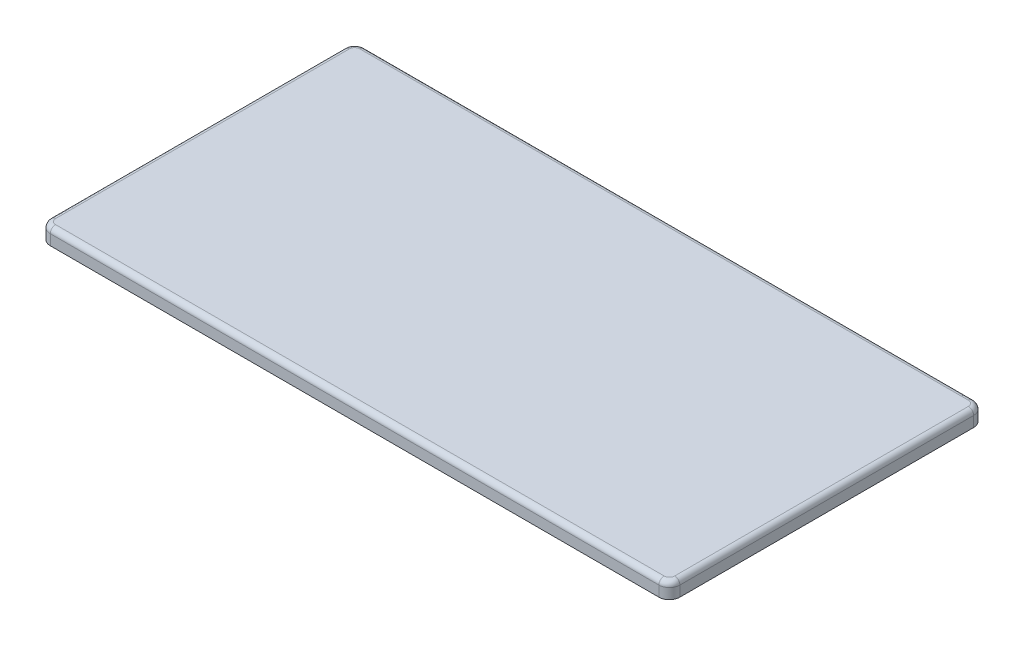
from build123d import *

# Parameters (mm, degrees)
EXTRUDE_1_DEPTH           = 1.5
FILLET_1_R                = 1
CUT_EXTRUDE_2_DEPTH       = 1
SKETCH_4_W                = 4.9
SKETCH_4_H                = 3.2
EXTRUDE_4_DEPTH           = 8
EXTRUDE_4_DRAFT           = 0.6
EXTRUDE_4_PROFILE_2_DEPTH = 8
EXTRUDE_4_PROFILE_2_DRAFT = 0.6
EXTRUDE_4_PROFILE_3_DEPTH = 8
EXTRUDE_4_PROFILE_3_DRAFT = 0.6
EXTRUDE_4_PROFILE_4_DEPTH = 8
EXTRUDE_4_PROFILE_4_DRAFT = 0.6
EXTRUDE_4_PROFILE_5_DEPTH = 8
EXTRUDE_4_PROFILE_5_DRAFT = 0.6
EXTRUDE_4_PROFILE_6_DEPTH = 8
EXTRUDE_4_PROFILE_6_DRAFT = 0.6
EXTRUDE_4_PROFILE_7_DEPTH = 8
EXTRUDE_4_PROFILE_7_DRAFT = 0.6
EXTRUDE_4_PROFILE_8_DEPTH = 8
EXTRUDE_4_PROFILE_8_DRAFT = 0.6
FILLET_2_R                = 0.8


with BuildPart() as part:
    # Sketch 1 → Extrude 1 (new, symmetric)
    with BuildSketch(Plane(origin=(0, 0, 0), x_dir=(0, 0, -1), z_dir=(0, 1, 0))):
        with BuildLine():
            Line((-28, 60), (28, 60))
            ThreePointArc((28, 60), (29.414213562, 59.414213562), (30, 58))
            Line((30, 58), (30, -58))
            ThreePointArc((30, -58), (29.414213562, -59.414213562), (28, -60))
            Line((28, -60), (-28, -60))
            ThreePointArc((-28, -60), (-29.414213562, -59.414213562), (-30, -58))
            Line((-30, -58), (-30, 58))
            ThreePointArc((-30, 58), (-29.414213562, 59.414213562), (-28, 60))
        make_face()
    extrude(amount=EXTRUDE_1_DEPTH, both=True)

    # Fillet 1
    fillet_1_edges = [part.edges().sort_by_distance(p)[0] for p in [
        (-59.414213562, 1.5, 29.414213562),
        (0, 1.5, 30),
        (59.414213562, 1.5, 29.414213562),
        (60, 1.5, 0),
        (59.414213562, 1.5, -29.414213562),
        (0, 1.5, -30),
        (-59.414213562, 1.5, -29.414213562),
        (-60, 1.5, 0),
    ]]
    fillet(fillet_1_edges, radius=FILLET_1_R)

    # Sketch 2 → Cut-Extrude 2 (cut)
    with BuildSketch(Plane.XZ.offset(1.5)):
        with BuildLine():
            Line((-58, 28.2), (58, 28.2))
            ThreePointArc((58, 28.2), (58.141421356, 28.141421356), (58.2, 28))
            Line((58.2, 28), (58.2, -28))
            ThreePointArc((58.2, -28), (58.141421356, -28.141421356), (58, -28.2))
            Line((58, -28.2), (-58, -28.2))
            ThreePointArc((-58, -28.2), (-58.141421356, -28.141421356), (-58.2, -28))
            Line((-58.2, -28), (-58.2, 28))
            ThreePointArc((-58.2, 28), (-58.141421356, 28.141421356), (-58, 28.2))
        make_face()
    extrude(amount=-CUT_EXTRUDE_2_DEPTH, mode=Mode.SUBTRACT)


with BuildPart() as extrude_4_tool:
    # Sketch 4 → Extrude 4 (with draft: the straight prism first)
    with BuildSketch(Plane.XZ.offset(0.5)):
        with Locations((-45, 15.85)):
            Rectangle(SKETCH_4_W, SKETCH_4_H)
    extrude(amount=EXTRUDE_4_DEPTH)
    # Extrude 4: the draft: its side faces are tilted about the plane it starts from
    extrude_4_sides = [extrude_4_tool.faces().sort_by_distance(p)[0] for p in [
        (-47.45, -4.5, 15.85),
        (-45, -4.5, 14.25),
        (-42.55, -4.5, 15.85),
        (-45, -4.5, 17.45),
    ]]
    draft(extrude_4_sides, Plane.XZ.offset(0.5), EXTRUDE_4_DRAFT)


with BuildPart() as part_1:
    add(part.part)

    # Extrude 4: add extrude_4_tool
    add(extrude_4_tool.part)


with BuildPart() as extrude_4_profile_2_tool:
    # Sketch 4 → Extrude 4 profile 2 (with draft: the straight prism first)
    with BuildSketch(Plane.XZ.offset(0.5)):
        with Locations((45, 15.85)):
            Rectangle(SKETCH_4_W, SKETCH_4_H)
    extrude(amount=EXTRUDE_4_PROFILE_2_DEPTH)
    # Extrude 4 profile 2: the draft: its side faces are tilted about the plane it starts from
    extrude_4_profile_2_sides = [extrude_4_profile_2_tool.faces().sort_by_distance(p)[0] for p in [
        (45, -4.5, 14.25),
        (47.45, -4.5, 15.85),
        (45, -4.5, 17.45),
        (42.55, -4.5, 15.85),
    ]]
    draft(extrude_4_profile_2_sides, Plane.XZ.offset(0.5), EXTRUDE_4_PROFILE_2_DRAFT)


with BuildPart() as part_2:
    add(part_1.part)

    # Extrude 4 profile 2: add extrude_4_profile_2_tool
    add(extrude_4_profile_2_tool.part)


with BuildPart() as extrude_4_profile_3_tool:
    # Sketch 4 → Extrude 4 profile 3 (with draft: the straight prism first)
    with BuildSketch(Plane.XZ.offset(0.5)):
        with Locations((-45, -15.85)):
            Rectangle(SKETCH_4_W, SKETCH_4_H)
    extrude(amount=EXTRUDE_4_PROFILE_3_DEPTH)
    # Extrude 4 profile 3: the draft: its side faces are tilted about the plane it starts from
    extrude_4_profile_3_sides = [extrude_4_profile_3_tool.faces().sort_by_distance(p)[0] for p in [
        (-47.45, -4.5, -15.85),
        (-45, -4.5, -17.45),
        (-42.55, -4.5, -15.85),
        (-45, -4.5, -14.25),
    ]]
    draft(extrude_4_profile_3_sides, Plane.XZ.offset(0.5), EXTRUDE_4_PROFILE_3_DRAFT)


with BuildPart() as part_3:
    add(part_2.part)

    # Extrude 4 profile 3: add extrude_4_profile_3_tool
    add(extrude_4_profile_3_tool.part)


with BuildPart() as extrude_4_profile_4_tool:
    # Sketch 4 → Extrude 4 profile 4 (with draft: the straight prism first)
    with BuildSketch(Plane.XZ.offset(0.5)):
        with Locations((45, -15.85)):
            Rectangle(SKETCH_4_W, SKETCH_4_H)
    extrude(amount=EXTRUDE_4_PROFILE_4_DEPTH)
    # Extrude 4 profile 4: the draft: its side faces are tilted about the plane it starts from
    extrude_4_profile_4_sides = [extrude_4_profile_4_tool.faces().sort_by_distance(p)[0] for p in [
        (42.55, -4.5, -15.85),
        (45, -4.5, -17.45),
        (47.45, -4.5, -15.85),
        (45, -4.5, -14.25),
    ]]
    draft(extrude_4_profile_4_sides, Plane.XZ.offset(0.5), EXTRUDE_4_PROFILE_4_DRAFT)


with BuildPart() as part_4:
    add(part_3.part)

    # Extrude 4 profile 4: add extrude_4_profile_4_tool
    add(extrude_4_profile_4_tool.part)


with BuildPart() as extrude_4_profile_5_tool:
    # Sketch 4 → Extrude 4 profile 5 (with draft: the straight prism first)
    with BuildSketch(Plane.XZ.offset(0.5)):
        with Locations((-15, 15.85)):
            Rectangle(SKETCH_4_W, SKETCH_4_H)
    extrude(amount=EXTRUDE_4_PROFILE_5_DEPTH)
    # Extrude 4 profile 5: the draft: its side faces are tilted about the plane it starts from
    extrude_4_profile_5_sides = [extrude_4_profile_5_tool.faces().sort_by_distance(p)[0] for p in [
        (-17.45, -4.5, 15.85),
        (-15, -4.5, 14.25),
        (-12.55, -4.5, 15.85),
        (-15, -4.5, 17.45),
    ]]
    draft(extrude_4_profile_5_sides, Plane.XZ.offset(0.5), EXTRUDE_4_PROFILE_5_DRAFT)


with BuildPart() as part_5:
    add(part_4.part)

    # Extrude 4 profile 5: add extrude_4_profile_5_tool
    add(extrude_4_profile_5_tool.part)


with BuildPart() as extrude_4_profile_6_tool:
    # Sketch 4 → Extrude 4 profile 6 (with draft: the straight prism first)
    with BuildSketch(Plane.XZ.offset(0.5)):
        with Locations((-15, -15.85)):
            Rectangle(SKETCH_4_W, SKETCH_4_H)
    extrude(amount=EXTRUDE_4_PROFILE_6_DEPTH)
    # Extrude 4 profile 6: the draft: its side faces are tilted about the plane it starts from
    extrude_4_profile_6_sides = [extrude_4_profile_6_tool.faces().sort_by_distance(p)[0] for p in [
        (-17.45, -4.5, -15.85),
        (-15, -4.5, -17.45),
        (-12.55, -4.5, -15.85),
        (-15, -4.5, -14.25),
    ]]
    draft(extrude_4_profile_6_sides, Plane.XZ.offset(0.5), EXTRUDE_4_PROFILE_6_DRAFT)


with BuildPart() as part_6:
    add(part_5.part)

    # Extrude 4 profile 6: add extrude_4_profile_6_tool
    add(extrude_4_profile_6_tool.part)


with BuildPart() as extrude_4_profile_7_tool:
    # Sketch 4 → Extrude 4 profile 7 (with draft: the straight prism first)
    with BuildSketch(Plane.XZ.offset(0.5)):
        with Locations((15, 15.85)):
            Rectangle(SKETCH_4_W, SKETCH_4_H)
    extrude(amount=EXTRUDE_4_PROFILE_7_DEPTH)
    # Extrude 4 profile 7: the draft: its side faces are tilted about the plane it starts from
    extrude_4_profile_7_sides = [extrude_4_profile_7_tool.faces().sort_by_distance(p)[0] for p in [
        (15, -4.5, 14.25),
        (17.45, -4.5, 15.85),
        (15, -4.5, 17.45),
        (12.55, -4.5, 15.85),
    ]]
    draft(extrude_4_profile_7_sides, Plane.XZ.offset(0.5), EXTRUDE_4_PROFILE_7_DRAFT)


with BuildPart() as part_7:
    add(part_6.part)

    # Extrude 4 profile 7: add extrude_4_profile_7_tool
    add(extrude_4_profile_7_tool.part)


with BuildPart() as extrude_4_profile_8_tool:
    # Sketch 4 → Extrude 4 profile 8 (with draft: the straight prism first)
    with BuildSketch(Plane.XZ.offset(0.5)):
        with Locations((15, -15.85)):
            Rectangle(SKETCH_4_W, SKETCH_4_H)
    extrude(amount=EXTRUDE_4_PROFILE_8_DEPTH)
    # Extrude 4 profile 8: the draft: its side faces are tilted about the plane it starts from
    extrude_4_profile_8_sides = [extrude_4_profile_8_tool.faces().sort_by_distance(p)[0] for p in [
        (15, -4.5, -17.45),
        (17.45, -4.5, -15.85),
        (15, -4.5, -14.25),
        (12.55, -4.5, -15.85),
    ]]
    draft(extrude_4_profile_8_sides, Plane.XZ.offset(0.5), EXTRUDE_4_PROFILE_8_DRAFT)


with BuildPart() as part_8:
    add(part_7.part)

    # Extrude 4 profile 8: add extrude_4_profile_8_tool
    add(extrude_4_profile_8_tool.part)

    # Fillet 2
    fillet_2_edges = [part_8.edges().sort_by_distance(p)[0] for p in [
        (42.633778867, -8.5, -15.85),
        (45, -8.5, -17.366221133),
        (47.366221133, -8.5, -15.85),
        (45, -8.5, -14.333778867),
        (-17.366221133, -8.5, 15.85),
        (-15, -8.5, 14.333778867),
        (-12.633778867, -8.5, 15.85),
        (-15, -8.5, 17.366221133),
        (-17.366221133, -8.5, -15.85),
        (-15, -8.5, -17.366221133),
        (-12.633778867, -8.5, -15.85),
        (-15, -8.5, -14.333778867),
        (12.633778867, -8.5, 15.85),
        (15, -8.5, 14.333778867),
        (17.366221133, -8.5, 15.85),
        (15, -8.5, 17.366221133),
        (12.633778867, -8.5, -15.85),
        (15, -8.5, -17.366221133),
        (17.366221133, -8.5, -15.85),
        (15, -8.5, -14.333778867),
        (-47.366221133, -8.5, 15.85),
        (-45, -8.5, 14.333778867),
        (-42.633778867, -8.5, 15.85),
        (-45, -8.5, 17.366221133),
        (42.633778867, -8.5, 15.85),
        (45, -8.5, 14.333778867),
        (47.366221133, -8.5, 15.85),
        (45, -8.5, 17.366221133),
        (-47.366221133, -8.5, -15.85),
        (-45, -8.5, -17.366221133),
        (-42.633778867, -8.5, -15.85),
        (-45, -8.5, -14.333778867),
    ]]
    fillet(fillet_2_edges, radius=FILLET_2_R)


solid = part_8.part
